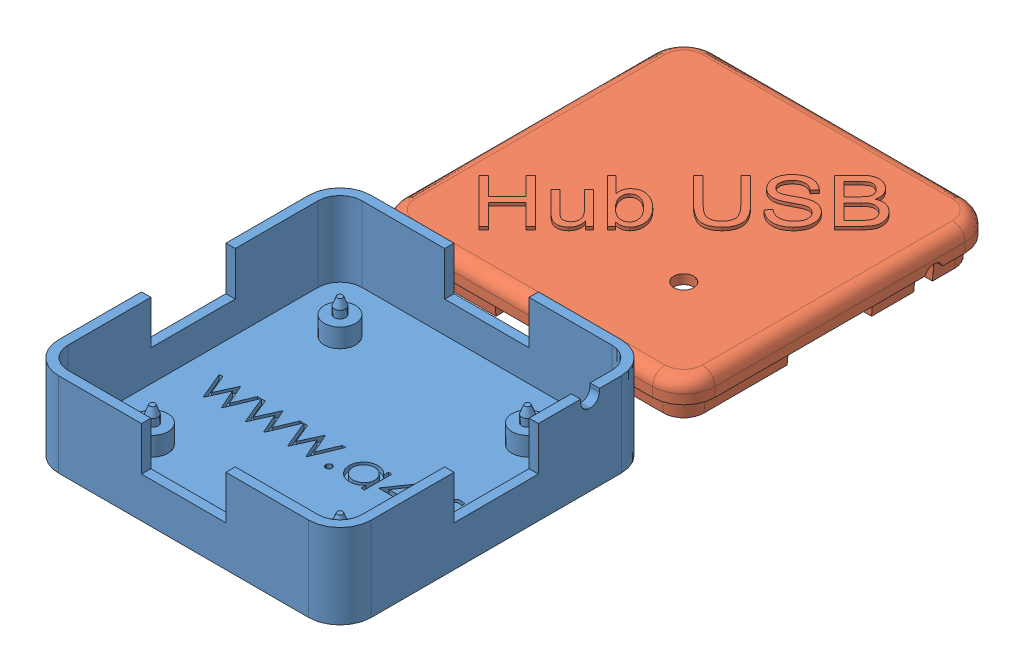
SolidWorks assembly Boitier_HubUSB-I3D.SLDASM, configuration Défaut (file format 6000). Lengths in mm.
Overall size (58.82 13.5 110.88).
2 component instances, 2 part files, 4 mates.
Components (placement in the parent):
- BoitierUB-USB-Fond-1: BoitierUB-USB-Fond.SLDPRT [Défaut] at (103.015 -6.3686 -26.6693) size (50 13.5 50)
- BoitierUB-USB-Couvercle-1: BoitierUB-USB-Couvercle.SLDPRT [Défaut] at (103.015 0.1314 -26.3307) x (1 0 0) z (0 0 -1) size (58.82 7 55.88)
Mates (geometry in assembly coordinates):
- Coïncidente1: coincident: plane of BoitierUB-USB-Fond-1 through (-52.1568 -6.3686 21) normal (0 -1 0); plane of BoitierUB-USB-Couvercle-1 through (-12.1068 -6.3686 -74.5025) normal (0 -1 0)
- Parallèle1: parallel: plane of BoitierUB-USB-Fond-1 through (-52.1568 7.1314 -24) normal (0 0 -1); line of BoitierUB-USB-Couvercle-1 through (-52.1568 0.1314 -31.4525) axis (1 0 0)
- Coïncidente2: coincident: plane of BoitierUB-USB-Fond-1 through (-7.1568 7.1314 -19) normal (1 0 0); plane of BoitierUB-USB-Couvercle-1 through (-7.1568 -3.3686 -34.4525) normal (1 0 0)
- Distance1: distance = 5 mm anti-aligned: plane of BoitierUB-USB-Couvercle-1 through (-52.1568 -3.3686 -29) normal (0 0 1); plane of BoitierUB-USB-Fond-1 through (-52.1568 7.1314 -24) normal (0 0 -1)
